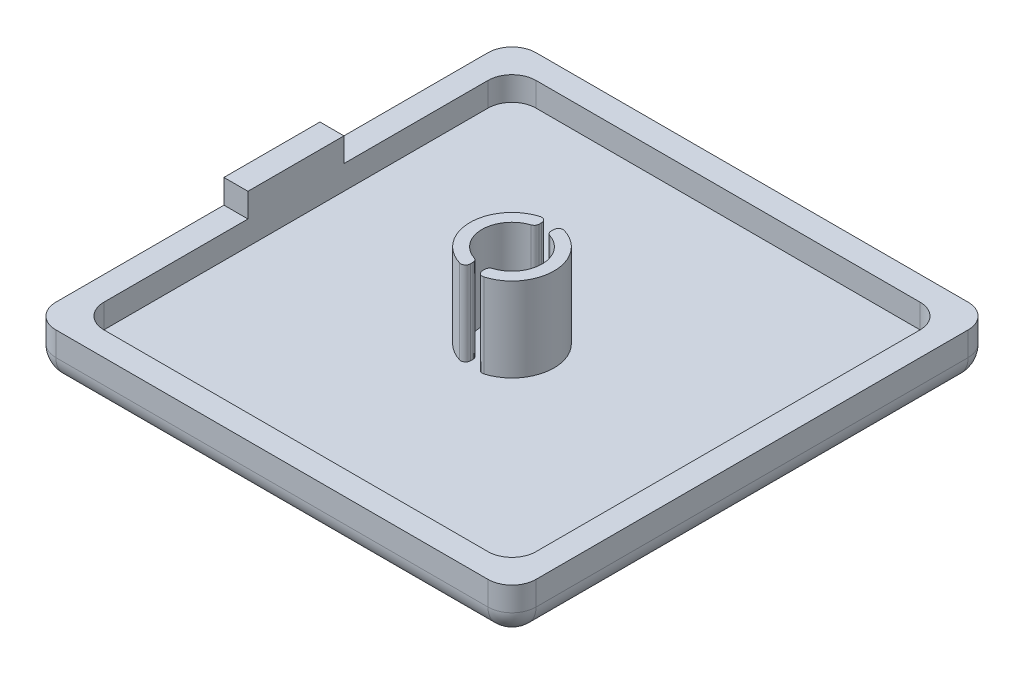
ISO-10303-21;
HEADER;
FILE_DESCRIPTION(('STEP AP214'),'2;1');
FILE_NAME('part.step','',(''),(''),'','','');
FILE_SCHEMA(('AUTOMOTIVE_DESIGN { 1 0 10303 214 1 1 1 1 }'));
ENDSEC;
DATA;
#1=APPLICATION_CONTEXT('core data for automotive mechanical design processes');
#2=APPLICATION_PROTOCOL_DEFINITION('international standard','automotive_design',2000,#1);
#3=PRODUCT_CONTEXT('',#1,'mechanical');
#4=PRODUCT('Part','Part','',(#3));
#5=PRODUCT_RELATED_PRODUCT_CATEGORY('part','',(#4));
#6=PRODUCT_DEFINITION_FORMATION('','',#4);
#7=PRODUCT_DEFINITION_CONTEXT('part definition',#1,'design');
#8=PRODUCT_DEFINITION('design','',#6,#7);
#9=PRODUCT_DEFINITION_SHAPE('','',#8);
#10=(LENGTH_UNIT() NAMED_UNIT(*) SI_UNIT(.MILLI.,.METRE.));
#11=(NAMED_UNIT(*) PLANE_ANGLE_UNIT() SI_UNIT($,.RADIAN.));
#12=(NAMED_UNIT(*) SI_UNIT($,.STERADIAN.) SOLID_ANGLE_UNIT());
#13=UNCERTAINTY_MEASURE_WITH_UNIT(LENGTH_MEASURE(1.E-05),#10,'distance_accuracy_value','');
#14=(GEOMETRIC_REPRESENTATION_CONTEXT(3) GLOBAL_UNCERTAINTY_ASSIGNED_CONTEXT((#13)) GLOBAL_UNIT_ASSIGNED_CONTEXT((#10,
#11,#12)) REPRESENTATION_CONTEXT('',''));
#15=CARTESIAN_POINT('',(0.,0.,0.));
#16=DIRECTION('',(0.,0.,1.));
#17=DIRECTION('',(1.,0.,0.));
#18=AXIS2_PLACEMENT_3D('',#15,#16,#17);
#19=CARTESIAN_POINT('',(0.,2.,0.));
#20=DIRECTION('',(0.,1.,0.));
#21=DIRECTION('',(0.,0.,1.));
#22=AXIS2_PLACEMENT_3D('',#19,#20,#21);
#23=PLANE('',#22);
#24=DIRECTION('',(1.,0.,0.));
#25=VECTOR('',#24,1.);
#26=CARTESIAN_POINT('',(0.,2.,-37.9988183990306));
#27=LINE('',#26,#25);
#28=CARTESIAN_POINT('',(4.,2.,-37.9988183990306));
#29=VERTEX_POINT('',#28);
#30=CARTESIAN_POINT('',(36.,2.,-37.9988183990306));
#31=VERTEX_POINT('',#30);
#32=EDGE_CURVE('E1180',#29,#31,#27,.T.);
#33=ORIENTED_EDGE('',*,*,#32,.F.);
#34=CARTESIAN_POINT('',(4.,2.,-35.9988183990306));
#35=DIRECTION('',(0.,1.,0.));
#36=DIRECTION('',(0.,0.,1.));
#37=AXIS2_PLACEMENT_3D('',#34,#35,#36);
#38=CIRCLE('',#37,2.);
#39=CARTESIAN_POINT('',(2.,2.,-35.9988183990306));
#40=VERTEX_POINT('',#39);
#41=EDGE_CURVE('E524',#29,#40,#38,.T.);
#42=ORIENTED_EDGE('',*,*,#41,.T.);
#43=DIRECTION('',(0.,0.,1.));
#44=VECTOR('',#43,1.);
#45=CARTESIAN_POINT('',(2.,2.,0.));
#46=LINE('',#45,#44);
#47=CARTESIAN_POINT('',(2.,2.,-4.));
#48=VERTEX_POINT('',#47);
#49=EDGE_CURVE('E1183',#40,#48,#46,.T.);
#50=ORIENTED_EDGE('',*,*,#49,.T.);
#51=CARTESIAN_POINT('',(4.,2.,-4.));
#52=DIRECTION('',(0.,1.,0.));
#53=DIRECTION('',(0.,0.,1.));
#54=AXIS2_PLACEMENT_3D('',#51,#52,#53);
#55=CIRCLE('',#54,2.);
#56=CARTESIAN_POINT('',(4.,2.,-2.));
#57=VERTEX_POINT('',#56);
#58=EDGE_CURVE('E533',#48,#57,#55,.T.);
#59=ORIENTED_EDGE('',*,*,#58,.T.);
#60=DIRECTION('',(1.,0.,0.));
#61=VECTOR('',#60,1.);
#62=CARTESIAN_POINT('',(0.,2.,-2.));
#63=LINE('',#62,#61);
#64=CARTESIAN_POINT('',(36.,2.,-2.));
#65=VERTEX_POINT('',#64);
#66=EDGE_CURVE('E354',#57,#65,#63,.T.);
#67=ORIENTED_EDGE('',*,*,#66,.T.);
#68=CARTESIAN_POINT('',(36.,2.,-4.));
#69=DIRECTION('',(0.,1.,0.));
#70=DIRECTION('',(0.,0.,1.));
#71=AXIS2_PLACEMENT_3D('',#68,#69,#70);
#72=CIRCLE('',#71,2.);
#73=CARTESIAN_POINT('',(38.,2.,-4.));
#74=VERTEX_POINT('',#73);
#75=EDGE_CURVE('E530',#65,#74,#72,.T.);
#76=ORIENTED_EDGE('',*,*,#75,.T.);
#77=DIRECTION('',(0.,0.,1.));
#78=VECTOR('',#77,1.);
#79=CARTESIAN_POINT('',(38.,2.,0.));
#80=LINE('',#79,#78);
#81=CARTESIAN_POINT('',(38.,2.,-35.9988183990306));
#82=VERTEX_POINT('',#81);
#83=EDGE_CURVE('E387',#82,#74,#80,.T.);
#84=ORIENTED_EDGE('',*,*,#83,.F.);
#85=CARTESIAN_POINT('',(36.,2.,-35.9988183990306));
#86=DIRECTION('',(0.,1.,0.));
#87=DIRECTION('',(0.,0.,1.));
#88=AXIS2_PLACEMENT_3D('',#85,#86,#87);
#89=CIRCLE('',#88,2.);
#90=EDGE_CURVE('E527',#82,#31,#89,.T.);
#91=ORIENTED_EDGE('',*,*,#90,.T.);
#92=EDGE_LOOP('',(#33,#42,#50,#59,#67,#76,#84,#91));
#93=FACE_BOUND('',#92,.T.);
#94=CARTESIAN_POINT('',(20.,2.,-19.9994091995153));
#95=DIRECTION('',(0.,-1.,0.));
#96=DIRECTION('',(0.,0.,1.));
#97=AXIS2_PLACEMENT_3D('',#94,#95,#96);
#98=CIRCLE('',#97,2.5);
#99=CARTESIAN_POINT('',(20.7758620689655,2.,-22.375969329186));
#100=VERTEX_POINT('',#99);
#101=CARTESIAN_POINT('',(20.7758620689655,2.,-17.6228490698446));
#102=VERTEX_POINT('',#101);
#103=EDGE_CURVE('E1095',#100,#102,#98,.T.);
#104=ORIENTED_EDGE('',*,*,#103,.F.);
#105=CARTESIAN_POINT('',(20.9,2.,-22.7562189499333));
#106=DIRECTION('',(0.,1.,0.));
#107=DIRECTION('',(0.,0.,1.));
#108=AXIS2_PLACEMENT_3D('',#105,#106,#107);
#109=CIRCLE('',#108,0.400000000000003);
#110=CARTESIAN_POINT('',(20.5,2.,-22.7562189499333));
#111=VERTEX_POINT('',#110);
#112=EDGE_CURVE('E1089',#111,#100,#109,.T.);
#113=ORIENTED_EDGE('',*,*,#112,.F.);
#114=DIRECTION('',(0.,0.,1.));
#115=VECTOR('',#114,1.);
#116=CARTESIAN_POINT('',(20.5,2.,-22.7562189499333));
#117=LINE('',#116,#115);
#118=CARTESIAN_POINT('',(20.5,2.,-22.9658885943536));
#119=VERTEX_POINT('',#118);
#120=EDGE_CURVE('E1107',#119,#111,#117,.T.);
#121=ORIENTED_EDGE('',*,*,#120,.F.);
#122=CARTESIAN_POINT('',(20.9,2.,-22.9658885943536));
#123=DIRECTION('',(0.,1.,0.));
#124=DIRECTION('',(0.,0.,-1.));
#125=AXIS2_PLACEMENT_3D('',#122,#123,#124);
#126=CIRCLE('',#125,0.400000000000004);
#127=CARTESIAN_POINT('',(21.016129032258,2.,-23.3486601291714));
#128=VERTEX_POINT('',#127);
#129=EDGE_CURVE('E1143',#128,#119,#126,.T.);
#130=ORIENTED_EDGE('',*,*,#129,.F.);
#131=CARTESIAN_POINT('',(20.,2.,-19.9994091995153));
#132=DIRECTION('',(0.,1.,0.));
#133=DIRECTION('',(0.,0.,1.));
#134=AXIS2_PLACEMENT_3D('',#131,#132,#133);
#135=CIRCLE('',#134,3.5);
#136=CARTESIAN_POINT('',(21.0161290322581,2.,-16.6501582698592));
#137=VERTEX_POINT('',#136);
#138=EDGE_CURVE('E1140',#137,#128,#135,.T.);
#139=ORIENTED_EDGE('',*,*,#138,.F.);
#140=CARTESIAN_POINT('',(20.9,2.,-17.032929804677));
#141=DIRECTION('',(0.,1.,0.));
#142=DIRECTION('',(0.,0.,1.));
#143=AXIS2_PLACEMENT_3D('',#140,#141,#142);
#144=CIRCLE('',#143,0.399999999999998);
#145=CARTESIAN_POINT('',(20.5,2.,-17.032929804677));
#146=VERTEX_POINT('',#145);
#147=EDGE_CURVE('E1137',#146,#137,#144,.T.);
#148=ORIENTED_EDGE('',*,*,#147,.F.);
#149=DIRECTION('',(0.,0.,1.));
#150=VECTOR('',#149,1.);
#151=CARTESIAN_POINT('',(20.5,2.,-17.2425994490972));
#152=LINE('',#151,#150);
#153=CARTESIAN_POINT('',(20.5,2.,-17.2425994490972));
#154=VERTEX_POINT('',#153);
#155=EDGE_CURVE('E1134',#154,#146,#152,.T.);
#156=ORIENTED_EDGE('',*,*,#155,.F.);
#157=CARTESIAN_POINT('',(20.9,2.,-17.2425994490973));
#158=DIRECTION('',(0.,1.,0.));
#159=DIRECTION('',(0.,0.,-1.));
#160=AXIS2_PLACEMENT_3D('',#157,#158,#159);
#161=CIRCLE('',#160,0.4);
#162=EDGE_CURVE('E1131',#102,#154,#161,.T.);
#163=ORIENTED_EDGE('',*,*,#162,.F.);
#164=EDGE_LOOP('',(#104,#113,#121,#130,#139,#148,#156,#163));
#165=FACE_BOUND('',#164,.T.);
#166=DIRECTION('',(0.,0.,-1.));
#167=VECTOR('',#166,1.);
#168=CARTESIAN_POINT('',(19.5,2.,-17.2425994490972));
#169=LINE('',#168,#167);
#170=CARTESIAN_POINT('',(19.5,2.,-17.032929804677));
#171=VERTEX_POINT('',#170);
#172=CARTESIAN_POINT('',(19.5,2.,-17.2425994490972));
#173=VERTEX_POINT('',#172);
#174=EDGE_CURVE('E1212',#171,#173,#169,.T.);
#175=ORIENTED_EDGE('',*,*,#174,.F.);
#176=CARTESIAN_POINT('',(19.1,2.,-17.032929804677));
#177=DIRECTION('',(0.,1.,0.));
#178=DIRECTION('',(0.,0.,-1.));
#179=AXIS2_PLACEMENT_3D('',#176,#177,#178);
#180=CIRCLE('',#179,0.400000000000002);
#181=CARTESIAN_POINT('',(18.9838709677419,2.,-16.6501582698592));
#182=VERTEX_POINT('',#181);
#183=EDGE_CURVE('E340',#182,#171,#180,.T.);
#184=ORIENTED_EDGE('',*,*,#183,.F.);
#185=CARTESIAN_POINT('',(20.,2.,-19.9994091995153));
#186=DIRECTION('',(0.,1.,0.));
#187=DIRECTION('',(0.,0.,1.));
#188=AXIS2_PLACEMENT_3D('',#185,#186,#187);
#189=CIRCLE('',#188,3.5);
#190=CARTESIAN_POINT('',(18.9838709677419,2.,-23.3486601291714));
#191=VERTEX_POINT('',#190);
#192=EDGE_CURVE('E1082',#191,#182,#189,.T.);
#193=ORIENTED_EDGE('',*,*,#192,.F.);
#194=CARTESIAN_POINT('',(19.1,2.,-22.9658885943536));
#195=DIRECTION('',(0.,1.,0.));
#196=DIRECTION('',(0.,0.,1.));
#197=AXIS2_PLACEMENT_3D('',#194,#195,#196);
#198=CIRCLE('',#197,0.400000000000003);
#199=CARTESIAN_POINT('',(19.5,2.,-22.9658885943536));
#200=VERTEX_POINT('',#199);
#201=EDGE_CURVE('E1227',#200,#191,#198,.T.);
#202=ORIENTED_EDGE('',*,*,#201,.F.);
#203=DIRECTION('',(0.,0.,-1.));
#204=VECTOR('',#203,1.);
#205=CARTESIAN_POINT('',(19.5,2.,-22.7562189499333));
#206=LINE('',#205,#204);
#207=CARTESIAN_POINT('',(19.5,2.,-22.7562189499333));
#208=VERTEX_POINT('',#207);
#209=EDGE_CURVE('E1224',#208,#200,#206,.T.);
#210=ORIENTED_EDGE('',*,*,#209,.F.);
#211=CARTESIAN_POINT('',(19.1,2.,-22.7562189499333));
#212=DIRECTION('',(0.,1.,0.));
#213=DIRECTION('',(0.,0.,1.));
#214=AXIS2_PLACEMENT_3D('',#211,#212,#213);
#215=CIRCLE('',#214,0.400000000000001);
#216=CARTESIAN_POINT('',(19.2241379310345,2.,-22.375969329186));
#217=VERTEX_POINT('',#216);
#218=EDGE_CURVE('E1221',#217,#208,#215,.T.);
#219=ORIENTED_EDGE('',*,*,#218,.F.);
#220=CARTESIAN_POINT('',(20.,2.,-19.9994091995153));
#221=DIRECTION('',(0.,-1.,0.));
#222=DIRECTION('',(0.,0.,1.));
#223=AXIS2_PLACEMENT_3D('',#220,#221,#222);
#224=CIRCLE('',#223,2.5);
#225=CARTESIAN_POINT('',(19.2241379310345,2.,-17.6228490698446));
#226=VERTEX_POINT('',#225);
#227=EDGE_CURVE('E1218',#226,#217,#224,.T.);
#228=ORIENTED_EDGE('',*,*,#227,.F.);
#229=CARTESIAN_POINT('',(19.1,2.,-17.2425994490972));
#230=DIRECTION('',(0.,1.,0.));
#231=DIRECTION('',(0.,0.,1.));
#232=AXIS2_PLACEMENT_3D('',#229,#230,#231);
#233=CIRCLE('',#232,0.400000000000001);
#234=EDGE_CURVE('E1215',#173,#226,#233,.T.);
#235=ORIENTED_EDGE('',*,*,#234,.F.);
#236=EDGE_LOOP('',(#175,#184,#193,#202,#210,#219,#228,#235));
#237=FACE_BOUND('',#236,.T.);
#238=ADVANCED_FACE('F43',(#93,#165,#237),#23,.T.);
#239=CARTESIAN_POINT('',(0.,4.,0.));
#240=DIRECTION('',(0.,1.,0.));
#241=DIRECTION('',(0.,0.,1.));
#242=AXIS2_PLACEMENT_3D('',#239,#240,#241);
#243=PLANE('',#242);
#244=DIRECTION('',(-1.,0.,0.));
#245=VECTOR('',#244,1.);
#246=CARTESIAN_POINT('',(2.,4.,-24.));
#247=LINE('',#246,#245);
#248=CARTESIAN_POINT('',(2.,4.,-24.));
#249=VERTEX_POINT('',#248);
#250=CARTESIAN_POINT('',(0.,4.,-24.));
#251=VERTEX_POINT('',#250);
#252=EDGE_CURVE('E303',#249,#251,#247,.T.);
#253=ORIENTED_EDGE('',*,*,#252,.F.);
#254=DIRECTION('',(0.,0.,1.));
#255=VECTOR('',#254,1.);
#256=CARTESIAN_POINT('',(2.,4.,-37.9988183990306));
#257=LINE('',#256,#255);
#258=CARTESIAN_POINT('',(2.,4.,-35.9988183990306));
#259=VERTEX_POINT('',#258);
#260=EDGE_CURVE('E318',#259,#249,#257,.T.);
#261=ORIENTED_EDGE('',*,*,#260,.F.);
#262=CARTESIAN_POINT('',(4.,4.,-35.9988183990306));
#263=DIRECTION('',(0.,1.,0.));
#264=DIRECTION('',(0.,0.,1.));
#265=AXIS2_PLACEMENT_3D('',#262,#263,#264);
#266=CIRCLE('',#265,2.);
#267=CARTESIAN_POINT('',(4.,4.,-37.9988183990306));
#268=VERTEX_POINT('',#267);
#269=EDGE_CURVE('E459',#259,#268,#266,.F.);
#270=ORIENTED_EDGE('',*,*,#269,.T.);
#271=DIRECTION('',(-1.,0.,0.));
#272=VECTOR('',#271,1.);
#273=CARTESIAN_POINT('',(2.,4.,-37.9988183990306));
#274=LINE('',#273,#272);
#275=CARTESIAN_POINT('',(36.,4.,-37.9988183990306));
#276=VERTEX_POINT('',#275);
#277=EDGE_CURVE('E369',#276,#268,#274,.T.);
#278=ORIENTED_EDGE('',*,*,#277,.F.);
#279=CARTESIAN_POINT('',(36.,4.,-35.9988183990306));
#280=DIRECTION('',(0.,1.,0.));
#281=DIRECTION('',(0.,0.,1.));
#282=AXIS2_PLACEMENT_3D('',#279,#280,#281);
#283=CIRCLE('',#282,2.);
#284=CARTESIAN_POINT('',(38.,4.,-35.9988183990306));
#285=VERTEX_POINT('',#284);
#286=EDGE_CURVE('E456',#276,#285,#283,.F.);
#287=ORIENTED_EDGE('',*,*,#286,.T.);
#288=DIRECTION('',(0.,0.,-1.));
#289=VECTOR('',#288,1.);
#290=CARTESIAN_POINT('',(38.,4.,-37.9988183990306));
#291=LINE('',#290,#289);
#292=CARTESIAN_POINT('',(38.,4.,-4.));
#293=VERTEX_POINT('',#292);
#294=EDGE_CURVE('E365',#293,#285,#291,.T.);
#295=ORIENTED_EDGE('',*,*,#294,.F.);
#296=CARTESIAN_POINT('',(36.,4.,-4.));
#297=DIRECTION('',(0.,1.,0.));
#298=DIRECTION('',(0.,0.,1.));
#299=AXIS2_PLACEMENT_3D('',#296,#297,#298);
#300=CIRCLE('',#299,2.);
#301=CARTESIAN_POINT('',(36.,4.,-2.));
#302=VERTEX_POINT('',#301);
#303=EDGE_CURVE('E453',#293,#302,#300,.F.);
#304=ORIENTED_EDGE('',*,*,#303,.T.);
#305=DIRECTION('',(1.,0.,0.));
#306=VECTOR('',#305,1.);
#307=CARTESIAN_POINT('',(2.,4.,-2.));
#308=LINE('',#307,#306);
#309=CARTESIAN_POINT('',(4.,4.,-2.));
#310=VERTEX_POINT('',#309);
#311=EDGE_CURVE('E360',#310,#302,#308,.T.);
#312=ORIENTED_EDGE('',*,*,#311,.F.);
#313=CARTESIAN_POINT('',(4.,4.,-4.));
#314=DIRECTION('',(0.,1.,0.));
#315=DIRECTION('',(0.,0.,1.));
#316=AXIS2_PLACEMENT_3D('',#313,#314,#315);
#317=CIRCLE('',#316,2.);
#318=CARTESIAN_POINT('',(2.,4.,-4.));
#319=VERTEX_POINT('',#318);
#320=EDGE_CURVE('E449',#310,#319,#317,.F.);
#321=ORIENTED_EDGE('',*,*,#320,.T.);
#322=CARTESIAN_POINT('',(2.,4.,-16.));
#323=VERTEX_POINT('',#322);
#324=EDGE_CURVE('E347',#323,#319,#257,.T.);
#325=ORIENTED_EDGE('',*,*,#324,.F.);
#326=DIRECTION('',(-1.,0.,0.));
#327=VECTOR('',#326,1.);
#328=CARTESIAN_POINT('',(2.,4.,-16.));
#329=LINE('',#328,#327);
#330=CARTESIAN_POINT('',(0.,4.,-16.));
#331=VERTEX_POINT('',#330);
#332=EDGE_CURVE('E341',#323,#331,#329,.T.);
#333=ORIENTED_EDGE('',*,*,#332,.T.);
#334=DIRECTION('',(0.,0.,1.));
#335=VECTOR('',#334,1.);
#336=CARTESIAN_POINT('',(0.,4.,-40.));
#337=LINE('',#336,#335);
#338=CARTESIAN_POINT('',(0.,4.,-2.));
#339=VERTEX_POINT('',#338);
#340=EDGE_CURVE('E373',#331,#339,#337,.T.);
#341=ORIENTED_EDGE('',*,*,#340,.T.);
#342=CARTESIAN_POINT('',(2.,4.,-2.));
#343=DIRECTION('',(0.,1.,0.));
#344=DIRECTION('',(0.,0.,1.));
#345=AXIS2_PLACEMENT_3D('',#342,#343,#344);
#346=CIRCLE('',#345,2.);
#347=CARTESIAN_POINT('',(2.,4.,0.));
#348=VERTEX_POINT('',#347);
#349=EDGE_CURVE('E482',#339,#348,#346,.T.);
#350=ORIENTED_EDGE('',*,*,#349,.T.);
#351=DIRECTION('',(1.,0.,0.));
#352=VECTOR('',#351,1.);
#353=CARTESIAN_POINT('',(0.,4.,0.));
#354=LINE('',#353,#352);
#355=CARTESIAN_POINT('',(38.,4.,0.));
#356=VERTEX_POINT('',#355);
#357=EDGE_CURVE('E376',#348,#356,#354,.T.);
#358=ORIENTED_EDGE('',*,*,#357,.T.);
#359=CARTESIAN_POINT('',(38.,4.,-2.));
#360=DIRECTION('',(0.,1.,0.));
#361=DIRECTION('',(0.,0.,1.));
#362=AXIS2_PLACEMENT_3D('',#359,#360,#361);
#363=CIRCLE('',#362,2.);
#364=CARTESIAN_POINT('',(40.,4.,-2.));
#365=VERTEX_POINT('',#364);
#366=EDGE_CURVE('E485',#356,#365,#363,.T.);
#367=ORIENTED_EDGE('',*,*,#366,.T.);
#368=DIRECTION('',(0.,0.,-1.));
#369=VECTOR('',#368,1.);
#370=CARTESIAN_POINT('',(40.,4.,-40.));
#371=LINE('',#370,#369);
#372=CARTESIAN_POINT('',(40.,4.,-38.));
#373=VERTEX_POINT('',#372);
#374=EDGE_CURVE('E546',#365,#373,#371,.T.);
#375=ORIENTED_EDGE('',*,*,#374,.T.);
#376=CARTESIAN_POINT('',(38.,4.,-38.));
#377=DIRECTION('',(0.,1.,0.));
#378=DIRECTION('',(0.,0.,1.));
#379=AXIS2_PLACEMENT_3D('',#376,#377,#378);
#380=CIRCLE('',#379,2.);
#381=CARTESIAN_POINT('',(38.,4.,-40.));
#382=VERTEX_POINT('',#381);
#383=EDGE_CURVE('E479',#373,#382,#380,.T.);
#384=ORIENTED_EDGE('',*,*,#383,.T.);
#385=DIRECTION('',(-1.,0.,0.));
#386=VECTOR('',#385,1.);
#387=CARTESIAN_POINT('',(0.,4.,-40.));
#388=LINE('',#387,#386);
#389=CARTESIAN_POINT('',(2.,4.,-40.));
#390=VERTEX_POINT('',#389);
#391=EDGE_CURVE('E543',#382,#390,#388,.T.);
#392=ORIENTED_EDGE('',*,*,#391,.T.);
#393=CARTESIAN_POINT('',(2.,4.,-38.));
#394=DIRECTION('',(0.,1.,0.));
#395=DIRECTION('',(0.,0.,1.));
#396=AXIS2_PLACEMENT_3D('',#393,#394,#395);
#397=CIRCLE('',#396,2.);
#398=CARTESIAN_POINT('',(0.,4.,-38.));
#399=VERTEX_POINT('',#398);
#400=EDGE_CURVE('E476',#390,#399,#397,.T.);
#401=ORIENTED_EDGE('',*,*,#400,.T.);
#402=EDGE_CURVE('E380',#399,#251,#337,.T.);
#403=ORIENTED_EDGE('',*,*,#402,.T.);
#404=EDGE_LOOP('',(#253,#261,#270,#278,#287,#295,#304,#312,#321,#325,#333,#341,#350,#358,#367,
#375,#384,#392,#401,#403));
#405=FACE_BOUND('',#404,.T.);
#406=ADVANCED_FACE('F556',(#405),#243,.T.);
#407=CARTESIAN_POINT('',(0.,0.,0.));
#408=DIRECTION('',(0.,1.,0.));
#409=DIRECTION('',(0.,0.,1.));
#410=AXIS2_PLACEMENT_3D('',#407,#408,#409);
#411=PLANE('',#410);
#412=DIRECTION('',(0.,0.,-1.));
#413=VECTOR('',#412,1.);
#414=CARTESIAN_POINT('',(38.,0.,0.));
#415=LINE('',#414,#413);
#416=CARTESIAN_POINT('',(38.,0.,-38.));
#417=VERTEX_POINT('',#416);
#418=CARTESIAN_POINT('',(38.,0.,-2.));
#419=VERTEX_POINT('',#418);
#420=EDGE_CURVE('E433',#417,#419,#415,.F.);
#421=ORIENTED_EDGE('',*,*,#420,.T.);
#422=DIRECTION('',(1.,0.,0.));
#423=VECTOR('',#422,1.);
#424=CARTESIAN_POINT('',(0.,0.,-2.));
#425=LINE('',#424,#423);
#426=CARTESIAN_POINT('',(2.,0.,-2.));
#427=VERTEX_POINT('',#426);
#428=EDGE_CURVE('E429',#419,#427,#425,.F.);
#429=ORIENTED_EDGE('',*,*,#428,.T.);
#430=DIRECTION('',(0.,0.,1.));
#431=VECTOR('',#430,1.);
#432=CARTESIAN_POINT('',(2.,0.,0.));
#433=LINE('',#432,#431);
#434=CARTESIAN_POINT('',(2.,0.,-38.));
#435=VERTEX_POINT('',#434);
#436=EDGE_CURVE('E439',#427,#435,#433,.F.);
#437=ORIENTED_EDGE('',*,*,#436,.T.);
#438=DIRECTION('',(-1.,0.,0.));
#439=VECTOR('',#438,1.);
#440=CARTESIAN_POINT('',(0.,0.,-38.));
#441=LINE('',#440,#439);
#442=EDGE_CURVE('E436',#435,#417,#441,.F.);
#443=ORIENTED_EDGE('',*,*,#442,.T.);
#444=EDGE_LOOP('',(#421,#429,#437,#443));
#445=FACE_BOUND('',#444,.T.);
#446=ADVANCED_FACE('F584',(#445),#411,.F.);
#447=CARTESIAN_POINT('',(0.,4.,-40.));
#448=DIRECTION('',(1.,0.,0.));
#449=DIRECTION('',(0.,0.,-1.));
#450=AXIS2_PLACEMENT_3D('',#447,#448,#449);
#451=PLANE('',#450);
#452=DIRECTION('',(0.,-1.,0.));
#453=VECTOR('',#452,1.);
#454=CARTESIAN_POINT('',(0.,4.,-38.));
#455=LINE('',#454,#453);
#456=CARTESIAN_POINT('',(0.,2.,-38.));
#457=VERTEX_POINT('',#456);
#458=EDGE_CURVE('E495',#399,#457,#455,.T.);
#459=ORIENTED_EDGE('',*,*,#458,.T.);
#460=DIRECTION('',(0.,0.,1.));
#461=VECTOR('',#460,1.);
#462=CARTESIAN_POINT('',(0.,2.,-40.));
#463=LINE('',#462,#461);
#464=CARTESIAN_POINT('',(0.,2.,-2.));
#465=VERTEX_POINT('',#464);
#466=EDGE_CURVE('E11',#457,#465,#463,.T.);
#467=ORIENTED_EDGE('',*,*,#466,.T.);
#468=DIRECTION('',(0.,-1.,0.));
#469=VECTOR('',#468,1.);
#470=CARTESIAN_POINT('',(0.,4.,-2.));
#471=LINE('',#470,#469);
#472=EDGE_CURVE('E499',#465,#339,#471,.F.);
#473=ORIENTED_EDGE('',*,*,#472,.T.);
#474=ORIENTED_EDGE('',*,*,#340,.F.);
#475=DIRECTION('',(0.,-1.,0.));
#476=VECTOR('',#475,1.);
#477=CARTESIAN_POINT('',(0.,0.,-16.));
#478=LINE('',#477,#476);
#479=CARTESIAN_POINT('',(0.,6.,-16.));
#480=VERTEX_POINT('',#479);
#481=EDGE_CURVE('E61',#480,#331,#478,.T.);
#482=ORIENTED_EDGE('',*,*,#481,.F.);
#483=DIRECTION('',(0.,0.,1.));
#484=VECTOR('',#483,1.);
#485=CARTESIAN_POINT('',(0.,6.00000000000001,0.));
#486=LINE('',#485,#484);
#487=CARTESIAN_POINT('',(0.,6.,-24.));
#488=VERTEX_POINT('',#487);
#489=EDGE_CURVE('E329',#488,#480,#486,.T.);
#490=ORIENTED_EDGE('',*,*,#489,.F.);
#491=DIRECTION('',(0.,-1.,0.));
#492=VECTOR('',#491,1.);
#493=CARTESIAN_POINT('',(0.,0.,-24.));
#494=LINE('',#493,#492);
#495=EDGE_CURVE('E298',#488,#251,#494,.T.);
#496=ORIENTED_EDGE('',*,*,#495,.T.);
#497=ORIENTED_EDGE('',*,*,#402,.F.);
#498=EDGE_LOOP('',(#459,#467,#473,#474,#482,#490,#496,#497));
#499=FACE_BOUND('',#498,.T.);
#500=ADVANCED_FACE('F606',(#499),#451,.F.);
#501=CARTESIAN_POINT('',(0.,4.,0.));
#502=DIRECTION('',(0.,0.,-1.));
#503=DIRECTION('',(-1.,0.,0.));
#504=AXIS2_PLACEMENT_3D('',#501,#502,#503);
#505=PLANE('',#504);
#506=DIRECTION('',(0.,-1.,0.));
#507=VECTOR('',#506,1.);
#508=CARTESIAN_POINT('',(2.,4.,0.));
#509=LINE('',#508,#507);
#510=CARTESIAN_POINT('',(2.,2.,0.));
#511=VERTEX_POINT('',#510);
#512=EDGE_CURVE('E462',#348,#511,#509,.T.);
#513=ORIENTED_EDGE('',*,*,#512,.T.);
#514=DIRECTION('',(1.,0.,0.));
#515=VECTOR('',#514,1.);
#516=CARTESIAN_POINT('',(0.,2.,0.));
#517=LINE('',#516,#515);
#518=CARTESIAN_POINT('',(38.,2.,0.));
#519=VERTEX_POINT('',#518);
#520=EDGE_CURVE('E442',#511,#519,#517,.T.);
#521=ORIENTED_EDGE('',*,*,#520,.T.);
#522=DIRECTION('',(0.,-1.,0.));
#523=VECTOR('',#522,1.);
#524=CARTESIAN_POINT('',(38.,4.,0.));
#525=LINE('',#524,#523);
#526=EDGE_CURVE('E466',#519,#356,#525,.F.);
#527=ORIENTED_EDGE('',*,*,#526,.T.);
#528=ORIENTED_EDGE('',*,*,#357,.F.);
#529=EDGE_LOOP('',(#513,#521,#527,#528));
#530=FACE_BOUND('',#529,.T.);
#531=ADVANCED_FACE('F619',(#530),#505,.F.);
#532=CARTESIAN_POINT('',(40.,4.,-40.));
#533=DIRECTION('',(-1.,0.,0.));
#534=DIRECTION('',(0.,0.,1.));
#535=AXIS2_PLACEMENT_3D('',#532,#533,#534);
#536=PLANE('',#535);
#537=DIRECTION('',(0.,-1.,0.));
#538=VECTOR('',#537,1.);
#539=CARTESIAN_POINT('',(40.,4.,-2.));
#540=LINE('',#539,#538);
#541=CARTESIAN_POINT('',(40.,2.,-2.));
#542=VERTEX_POINT('',#541);
#543=EDGE_CURVE('E472',#365,#542,#540,.T.);
#544=ORIENTED_EDGE('',*,*,#543,.T.);
#545=DIRECTION('',(0.,0.,-1.));
#546=VECTOR('',#545,1.);
#547=CARTESIAN_POINT('',(40.,2.,-40.));
#548=LINE('',#547,#546);
#549=CARTESIAN_POINT('',(40.,2.,-38.));
#550=VERTEX_POINT('',#549);
#551=EDGE_CURVE('E423',#542,#550,#548,.T.);
#552=ORIENTED_EDGE('',*,*,#551,.T.);
#553=DIRECTION('',(0.,-1.,0.));
#554=VECTOR('',#553,1.);
#555=CARTESIAN_POINT('',(40.,4.,-38.));
#556=LINE('',#555,#554);
#557=EDGE_CURVE('E469',#550,#373,#556,.F.);
#558=ORIENTED_EDGE('',*,*,#557,.T.);
#559=ORIENTED_EDGE('',*,*,#374,.F.);
#560=EDGE_LOOP('',(#544,#552,#558,#559));
#561=FACE_BOUND('',#560,.T.);
#562=ADVANCED_FACE('F567',(#561),#536,.F.);
#563=CARTESIAN_POINT('',(0.,4.,-40.));
#564=DIRECTION('',(0.,0.,1.));
#565=DIRECTION('',(1.,0.,0.));
#566=AXIS2_PLACEMENT_3D('',#563,#564,#565);
#567=PLANE('',#566);
#568=DIRECTION('',(0.,-1.,0.));
#569=VECTOR('',#568,1.);
#570=CARTESIAN_POINT('',(38.,4.,-40.));
#571=LINE('',#570,#569);
#572=CARTESIAN_POINT('',(38.,2.,-40.));
#573=VERTEX_POINT('',#572);
#574=EDGE_CURVE('E491',#382,#573,#571,.T.);
#575=ORIENTED_EDGE('',*,*,#574,.T.);
#576=DIRECTION('',(-1.,0.,0.));
#577=VECTOR('',#576,1.);
#578=CARTESIAN_POINT('',(0.,2.,-40.));
#579=LINE('',#578,#577);
#580=CARTESIAN_POINT('',(2.,2.,-40.));
#581=VERTEX_POINT('',#580);
#582=EDGE_CURVE('E417',#573,#581,#579,.T.);
#583=ORIENTED_EDGE('',*,*,#582,.T.);
#584=DIRECTION('',(0.,-1.,0.));
#585=VECTOR('',#584,1.);
#586=CARTESIAN_POINT('',(2.,4.,-40.));
#587=LINE('',#586,#585);
#588=EDGE_CURVE('E488',#581,#390,#587,.F.);
#589=ORIENTED_EDGE('',*,*,#588,.T.);
#590=ORIENTED_EDGE('',*,*,#391,.F.);
#591=EDGE_LOOP('',(#575,#583,#589,#590));
#592=FACE_BOUND('',#591,.T.);
#593=ADVANCED_FACE('F598',(#592),#567,.F.);
#594=CARTESIAN_POINT('',(2.,4.,-37.9988183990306));
#595=DIRECTION('',(1.,0.,0.));
#596=DIRECTION('',(0.,0.,-1.));
#597=AXIS2_PLACEMENT_3D('',#594,#595,#596);
#598=PLANE('',#597);
#599=ORIENTED_EDGE('',*,*,#49,.F.);
#600=DIRECTION('',(0.,-1.,0.));
#601=VECTOR('',#600,1.);
#602=CARTESIAN_POINT('',(2.,4.,-35.9988183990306));
#603=LINE('',#602,#601);
#604=EDGE_CURVE('E517',#40,#259,#603,.F.);
#605=ORIENTED_EDGE('',*,*,#604,.T.);
#606=ORIENTED_EDGE('',*,*,#260,.T.);
#607=DIRECTION('',(0.,-1.,0.));
#608=VECTOR('',#607,1.);
#609=CARTESIAN_POINT('',(2.,0.,-24.));
#610=LINE('',#609,#608);
#611=CARTESIAN_POINT('',(2.,6.,-24.));
#612=VERTEX_POINT('',#611);
#613=EDGE_CURVE('E295',#612,#249,#610,.T.);
#614=ORIENTED_EDGE('',*,*,#613,.F.);
#615=DIRECTION('',(0.,0.,1.));
#616=VECTOR('',#615,1.);
#617=CARTESIAN_POINT('',(2.,6.00000000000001,0.));
#618=LINE('',#617,#616);
#619=CARTESIAN_POINT('',(2.,6.,-16.));
#620=VERTEX_POINT('',#619);
#621=EDGE_CURVE('E308',#612,#620,#618,.T.);
#622=ORIENTED_EDGE('',*,*,#621,.T.);
#623=DIRECTION('',(0.,-1.,0.));
#624=VECTOR('',#623,1.);
#625=CARTESIAN_POINT('',(2.,0.,-16.));
#626=LINE('',#625,#624);
#627=EDGE_CURVE('E304',#620,#323,#626,.T.);
#628=ORIENTED_EDGE('',*,*,#627,.T.);
#629=ORIENTED_EDGE('',*,*,#324,.T.);
#630=DIRECTION('',(0.,-1.,0.));
#631=VECTOR('',#630,1.);
#632=CARTESIAN_POINT('',(2.,2.,-4.));
#633=LINE('',#632,#631);
#634=EDGE_CURVE('E520',#319,#48,#633,.T.);
#635=ORIENTED_EDGE('',*,*,#634,.T.);
#636=EDGE_LOOP('',(#599,#605,#606,#614,#622,#628,#629,#635));
#637=FACE_BOUND('',#636,.T.);
#638=ADVANCED_FACE('F316',(#637),#598,.T.);
#639=CARTESIAN_POINT('',(2.,4.,-2.));
#640=DIRECTION('',(0.,0.,-1.));
#641=DIRECTION('',(-1.,0.,0.));
#642=AXIS2_PLACEMENT_3D('',#639,#640,#641);
#643=PLANE('',#642);
#644=ORIENTED_EDGE('',*,*,#311,.T.);
#645=DIRECTION('',(0.,-1.,0.));
#646=VECTOR('',#645,1.);
#647=CARTESIAN_POINT('',(36.,2.,-2.));
#648=LINE('',#647,#646);
#649=EDGE_CURVE('E503',#302,#65,#648,.T.);
#650=ORIENTED_EDGE('',*,*,#649,.T.);
#651=ORIENTED_EDGE('',*,*,#66,.F.);
#652=DIRECTION('',(0.,-1.,0.));
#653=VECTOR('',#652,1.);
#654=CARTESIAN_POINT('',(4.,4.,-2.));
#655=LINE('',#654,#653);
#656=EDGE_CURVE('E507',#57,#310,#655,.F.);
#657=ORIENTED_EDGE('',*,*,#656,.T.);
#658=EDGE_LOOP('',(#644,#650,#651,#657));
#659=FACE_BOUND('',#658,.T.);
#660=ADVANCED_FACE('F649',(#659),#643,.T.);
#661=CARTESIAN_POINT('',(38.,4.,-37.9988183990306));
#662=DIRECTION('',(-1.,0.,0.));
#663=DIRECTION('',(0.,0.,1.));
#664=AXIS2_PLACEMENT_3D('',#661,#662,#663);
#665=PLANE('',#664);
#666=ORIENTED_EDGE('',*,*,#294,.T.);
#667=DIRECTION('',(0.,-1.,0.));
#668=VECTOR('',#667,1.);
#669=CARTESIAN_POINT('',(38.,2.,-35.9988183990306));
#670=LINE('',#669,#668);
#671=EDGE_CURVE('E510',#285,#82,#670,.T.);
#672=ORIENTED_EDGE('',*,*,#671,.T.);
#673=ORIENTED_EDGE('',*,*,#83,.T.);
#674=DIRECTION('',(0.,-1.,0.));
#675=VECTOR('',#674,1.);
#676=CARTESIAN_POINT('',(38.,4.,-4.));
#677=LINE('',#676,#675);
#678=EDGE_CURVE('E514',#74,#293,#677,.F.);
#679=ORIENTED_EDGE('',*,*,#678,.T.);
#680=EDGE_LOOP('',(#666,#672,#673,#679));
#681=FACE_BOUND('',#680,.T.);
#682=ADVANCED_FACE('F645',(#681),#665,.T.);
#683=CARTESIAN_POINT('',(2.,4.,-37.9988183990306));
#684=DIRECTION('',(0.,0.,1.));
#685=DIRECTION('',(1.,0.,0.));
#686=AXIS2_PLACEMENT_3D('',#683,#684,#685);
#687=PLANE('',#686);
#688=ORIENTED_EDGE('',*,*,#277,.T.);
#689=DIRECTION('',(0.,-1.,0.));
#690=VECTOR('',#689,1.);
#691=CARTESIAN_POINT('',(4.,2.,-37.9988183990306));
#692=LINE('',#691,#690);
#693=EDGE_CURVE('E536',#268,#29,#692,.T.);
#694=ORIENTED_EDGE('',*,*,#693,.T.);
#695=ORIENTED_EDGE('',*,*,#32,.T.);
#696=DIRECTION('',(0.,-1.,0.));
#697=VECTOR('',#696,1.);
#698=CARTESIAN_POINT('',(36.,4.,-37.9988183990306));
#699=LINE('',#698,#697);
#700=EDGE_CURVE('E540',#31,#276,#699,.F.);
#701=ORIENTED_EDGE('',*,*,#700,.T.);
#702=EDGE_LOOP('',(#688,#694,#695,#701));
#703=FACE_BOUND('',#702,.T.);
#704=ADVANCED_FACE('F641',(#703),#687,.T.);
#705=CARTESIAN_POINT('',(4.,4.,-35.9988183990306));
#706=DIRECTION('',(0.,1.,0.));
#707=DIRECTION('',(0.,0.,1.));
#708=AXIS2_PLACEMENT_3D('',#705,#706,#707);
#709=CYLINDRICAL_SURFACE('',#708,2.);
#710=ORIENTED_EDGE('',*,*,#269,.F.);
#711=ORIENTED_EDGE('',*,*,#604,.F.);
#712=ORIENTED_EDGE('',*,*,#41,.F.);
#713=ORIENTED_EDGE('',*,*,#693,.F.);
#714=EDGE_LOOP('',(#710,#711,#712,#713));
#715=FACE_BOUND('',#714,.T.);
#716=ADVANCED_FACE('F644',(#715),#709,.F.);
#717=CARTESIAN_POINT('',(36.,4.,-35.9988183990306));
#718=DIRECTION('',(0.,1.,0.));
#719=DIRECTION('',(0.,0.,1.));
#720=AXIS2_PLACEMENT_3D('',#717,#718,#719);
#721=CYLINDRICAL_SURFACE('',#720,2.);
#722=ORIENTED_EDGE('',*,*,#286,.F.);
#723=ORIENTED_EDGE('',*,*,#700,.F.);
#724=ORIENTED_EDGE('',*,*,#90,.F.);
#725=ORIENTED_EDGE('',*,*,#671,.F.);
#726=EDGE_LOOP('',(#722,#723,#724,#725));
#727=FACE_BOUND('',#726,.T.);
#728=ADVANCED_FACE('F688',(#727),#721,.F.);
#729=CARTESIAN_POINT('',(36.,4.,-4.));
#730=DIRECTION('',(0.,1.,0.));
#731=DIRECTION('',(0.,0.,1.));
#732=AXIS2_PLACEMENT_3D('',#729,#730,#731);
#733=CYLINDRICAL_SURFACE('',#732,2.);
#734=ORIENTED_EDGE('',*,*,#303,.F.);
#735=ORIENTED_EDGE('',*,*,#678,.F.);
#736=ORIENTED_EDGE('',*,*,#75,.F.);
#737=ORIENTED_EDGE('',*,*,#649,.F.);
#738=EDGE_LOOP('',(#734,#735,#736,#737));
#739=FACE_BOUND('',#738,.T.);
#740=ADVANCED_FACE('F696',(#739),#733,.F.);
#741=CARTESIAN_POINT('',(4.,4.,-4.));
#742=DIRECTION('',(0.,1.,0.));
#743=DIRECTION('',(0.,0.,1.));
#744=AXIS2_PLACEMENT_3D('',#741,#742,#743);
#745=CYLINDRICAL_SURFACE('',#744,2.);
#746=ORIENTED_EDGE('',*,*,#320,.F.);
#747=ORIENTED_EDGE('',*,*,#656,.F.);
#748=ORIENTED_EDGE('',*,*,#58,.F.);
#749=ORIENTED_EDGE('',*,*,#634,.F.);
#750=EDGE_LOOP('',(#746,#747,#748,#749));
#751=FACE_BOUND('',#750,.T.);
#752=ADVANCED_FACE('F704',(#751),#745,.F.);
#753=CARTESIAN_POINT('',(2.,4.,-38.));
#754=DIRECTION('',(0.,-1.,0.));
#755=DIRECTION('',(0.,0.,-1.));
#756=AXIS2_PLACEMENT_3D('',#753,#754,#755);
#757=CYLINDRICAL_SURFACE('',#756,2.);
#758=ORIENTED_EDGE('',*,*,#588,.F.);
#759=CARTESIAN_POINT('',(2.,2.,-38.));
#760=DIRECTION('',(0.,-1.,0.));
#761=DIRECTION('',(0.,0.,-1.));
#762=AXIS2_PLACEMENT_3D('',#759,#760,#761);
#763=CIRCLE('',#762,2.);
#764=EDGE_CURVE('E53',#581,#457,#763,.F.);
#765=ORIENTED_EDGE('',*,*,#764,.T.);
#766=ORIENTED_EDGE('',*,*,#458,.F.);
#767=ORIENTED_EDGE('',*,*,#400,.F.);
#768=EDGE_LOOP('',(#758,#765,#766,#767));
#769=FACE_BOUND('',#768,.T.);
#770=ADVANCED_FACE('F603',(#769),#757,.T.);
#771=CARTESIAN_POINT('',(38.,4.,-38.));
#772=DIRECTION('',(0.,-1.,0.));
#773=DIRECTION('',(0.,0.,-1.));
#774=AXIS2_PLACEMENT_3D('',#771,#772,#773);
#775=CYLINDRICAL_SURFACE('',#774,2.);
#776=ORIENTED_EDGE('',*,*,#557,.F.);
#777=CARTESIAN_POINT('',(38.,2.,-38.));
#778=DIRECTION('',(0.,-1.,0.));
#779=DIRECTION('',(0.,0.,-1.));
#780=AXIS2_PLACEMENT_3D('',#777,#778,#779);
#781=CIRCLE('',#780,2.);
#782=EDGE_CURVE('E420',#550,#573,#781,.F.);
#783=ORIENTED_EDGE('',*,*,#782,.T.);
#784=ORIENTED_EDGE('',*,*,#574,.F.);
#785=ORIENTED_EDGE('',*,*,#383,.F.);
#786=EDGE_LOOP('',(#776,#783,#784,#785));
#787=FACE_BOUND('',#786,.T.);
#788=ADVANCED_FACE('F595',(#787),#775,.T.);
#789=CARTESIAN_POINT('',(2.,4.,-2.));
#790=DIRECTION('',(0.,-1.,0.));
#791=DIRECTION('',(0.,0.,-1.));
#792=AXIS2_PLACEMENT_3D('',#789,#790,#791);
#793=CYLINDRICAL_SURFACE('',#792,2.);
#794=ORIENTED_EDGE('',*,*,#472,.F.);
#795=CARTESIAN_POINT('',(2.,2.,-2.));
#796=DIRECTION('',(0.,-1.,0.));
#797=DIRECTION('',(0.,0.,-1.));
#798=AXIS2_PLACEMENT_3D('',#795,#796,#797);
#799=CIRCLE('',#798,2.);
#800=EDGE_CURVE('E445',#465,#511,#799,.F.);
#801=ORIENTED_EDGE('',*,*,#800,.T.);
#802=ORIENTED_EDGE('',*,*,#512,.F.);
#803=ORIENTED_EDGE('',*,*,#349,.F.);
#804=EDGE_LOOP('',(#794,#801,#802,#803));
#805=FACE_BOUND('',#804,.T.);
#806=ADVANCED_FACE('F618',(#805),#793,.T.);
#807=CARTESIAN_POINT('',(38.,4.,-2.));
#808=DIRECTION('',(0.,-1.,0.));
#809=DIRECTION('',(0.,0.,-1.));
#810=AXIS2_PLACEMENT_3D('',#807,#808,#809);
#811=CYLINDRICAL_SURFACE('',#810,2.);
#812=ORIENTED_EDGE('',*,*,#526,.F.);
#813=CARTESIAN_POINT('',(38.,2.,-2.));
#814=DIRECTION('',(0.,-1.,0.));
#815=DIRECTION('',(0.,0.,-1.));
#816=AXIS2_PLACEMENT_3D('',#813,#814,#815);
#817=CIRCLE('',#816,2.);
#818=EDGE_CURVE('E426',#519,#542,#817,.F.);
#819=ORIENTED_EDGE('',*,*,#818,.T.);
#820=ORIENTED_EDGE('',*,*,#543,.F.);
#821=ORIENTED_EDGE('',*,*,#366,.F.);
#822=EDGE_LOOP('',(#812,#819,#820,#821));
#823=FACE_BOUND('',#822,.T.);
#824=ADVANCED_FACE('F563',(#823),#811,.T.);
#825=CARTESIAN_POINT('',(38.,2.,-38.));
#826=DIRECTION('',(0.,0.,1.));
#827=DIRECTION('',(1.,0.,0.));
#828=AXIS2_PLACEMENT_3D('',#825,#826,#827);
#829=SPHERICAL_SURFACE('',#828,2.);
#830=CARTESIAN_POINT('',(38.,2.,-38.));
#831=DIRECTION('',(-1.,0.,0.));
#832=DIRECTION('',(0.,0.,1.));
#833=AXIS2_PLACEMENT_3D('',#830,#831,#832);
#834=CIRCLE('',#833,2.);
#835=EDGE_CURVE('E388',#573,#417,#834,.T.);
#836=ORIENTED_EDGE('',*,*,#835,.F.);
#837=ORIENTED_EDGE('',*,*,#782,.F.);
#838=CARTESIAN_POINT('',(38.,2.,-38.));
#839=DIRECTION('',(0.,0.,1.));
#840=DIRECTION('',(1.,0.,0.));
#841=AXIS2_PLACEMENT_3D('',#838,#839,#840);
#842=CIRCLE('',#841,2.);
#843=EDGE_CURVE('E383',#417,#550,#842,.T.);
#844=ORIENTED_EDGE('',*,*,#843,.F.);
#845=EDGE_LOOP('',(#836,#837,#844));
#846=FACE_BOUND('',#845,.T.);
#847=ADVANCED_FACE('F45',(#846),#829,.T.);
#848=CARTESIAN_POINT('',(38.,2.,-40.));
#849=DIRECTION('',(0.,0.,-1.));
#850=DIRECTION('',(-1.,0.,0.));
#851=AXIS2_PLACEMENT_3D('',#848,#849,#850);
#852=CYLINDRICAL_SURFACE('',#851,2.);
#853=ORIENTED_EDGE('',*,*,#843,.T.);
#854=ORIENTED_EDGE('',*,*,#551,.F.);
#855=CARTESIAN_POINT('',(38.,2.,-2.));
#856=DIRECTION('',(0.,0.,1.));
#857=DIRECTION('',(1.,0.,0.));
#858=AXIS2_PLACEMENT_3D('',#855,#856,#857);
#859=CIRCLE('',#858,2.);
#860=EDGE_CURVE('E392',#419,#542,#859,.T.);
#861=ORIENTED_EDGE('',*,*,#860,.F.);
#862=ORIENTED_EDGE('',*,*,#420,.F.);
#863=EDGE_LOOP('',(#853,#854,#861,#862));
#864=FACE_BOUND('',#863,.T.);
#865=ADVANCED_FACE('F571',(#864),#852,.T.);
#866=CARTESIAN_POINT('',(0.,2.,-38.));
#867=DIRECTION('',(-1.,0.,0.));
#868=DIRECTION('',(0.,0.,1.));
#869=AXIS2_PLACEMENT_3D('',#866,#867,#868);
#870=CYLINDRICAL_SURFACE('',#869,2.);
#871=ORIENTED_EDGE('',*,*,#835,.T.);
#872=ORIENTED_EDGE('',*,*,#442,.F.);
#873=CARTESIAN_POINT('',(2.,2.,-38.));
#874=DIRECTION('',(-1.,0.,0.));
#875=DIRECTION('',(0.,0.,1.));
#876=AXIS2_PLACEMENT_3D('',#873,#874,#875);
#877=CIRCLE('',#876,2.);
#878=EDGE_CURVE('E396',#581,#435,#877,.T.);
#879=ORIENTED_EDGE('',*,*,#878,.F.);
#880=ORIENTED_EDGE('',*,*,#582,.F.);
#881=EDGE_LOOP('',(#871,#872,#879,#880));
#882=FACE_BOUND('',#881,.T.);
#883=ADVANCED_FACE('F590',(#882),#870,.T.);
#884=CARTESIAN_POINT('',(38.,2.,-2.));
#885=DIRECTION('',(0.,0.,1.));
#886=DIRECTION('',(1.,0.,0.));
#887=AXIS2_PLACEMENT_3D('',#884,#885,#886);
#888=SPHERICAL_SURFACE('',#887,2.);
#889=ORIENTED_EDGE('',*,*,#860,.T.);
#890=ORIENTED_EDGE('',*,*,#818,.F.);
#891=CARTESIAN_POINT('',(38.,2.,-2.));
#892=DIRECTION('',(-1.,0.,0.));
#893=DIRECTION('',(0.,0.,1.));
#894=AXIS2_PLACEMENT_3D('',#891,#892,#893);
#895=CIRCLE('',#894,2.);
#896=EDGE_CURVE('E400',#419,#519,#895,.T.);
#897=ORIENTED_EDGE('',*,*,#896,.F.);
#898=EDGE_LOOP('',(#889,#890,#897));
#899=FACE_BOUND('',#898,.T.);
#900=ADVANCED_FACE('F576',(#899),#888,.T.);
#901=CARTESIAN_POINT('',(2.,2.,-38.));
#902=DIRECTION('',(0.,0.,1.));
#903=DIRECTION('',(1.,0.,0.));
#904=AXIS2_PLACEMENT_3D('',#901,#902,#903);
#905=SPHERICAL_SURFACE('',#904,2.);
#906=ORIENTED_EDGE('',*,*,#764,.F.);
#907=ORIENTED_EDGE('',*,*,#878,.T.);
#908=CARTESIAN_POINT('',(2.,2.,-38.));
#909=DIRECTION('',(0.,0.,1.));
#910=DIRECTION('',(1.,0.,0.));
#911=AXIS2_PLACEMENT_3D('',#908,#909,#910);
#912=CIRCLE('',#911,2.);
#913=EDGE_CURVE('E404',#457,#435,#912,.T.);
#914=ORIENTED_EDGE('',*,*,#913,.F.);
#915=EDGE_LOOP('',(#906,#907,#914));
#916=FACE_BOUND('',#915,.T.);
#917=ADVANCED_FACE('F610',(#916),#905,.T.);
#918=CARTESIAN_POINT('',(0.,2.,-2.));
#919=DIRECTION('',(1.,0.,0.));
#920=DIRECTION('',(0.,0.,-1.));
#921=AXIS2_PLACEMENT_3D('',#918,#919,#920);
#922=CYLINDRICAL_SURFACE('',#921,2.);
#923=ORIENTED_EDGE('',*,*,#896,.T.);
#924=ORIENTED_EDGE('',*,*,#520,.F.);
#925=CARTESIAN_POINT('',(2.,2.,-2.));
#926=DIRECTION('',(-1.,0.,0.));
#927=DIRECTION('',(0.,0.,1.));
#928=AXIS2_PLACEMENT_3D('',#925,#926,#927);
#929=CIRCLE('',#928,2.);
#930=EDGE_CURVE('E408',#427,#511,#929,.T.);
#931=ORIENTED_EDGE('',*,*,#930,.F.);
#932=ORIENTED_EDGE('',*,*,#428,.F.);
#933=EDGE_LOOP('',(#923,#924,#931,#932));
#934=FACE_BOUND('',#933,.T.);
#935=ADVANCED_FACE('F581',(#934),#922,.T.);
#936=CARTESIAN_POINT('',(2.,2.,-40.));
#937=DIRECTION('',(0.,0.,1.));
#938=DIRECTION('',(1.,0.,0.));
#939=AXIS2_PLACEMENT_3D('',#936,#937,#938);
#940=CYLINDRICAL_SURFACE('',#939,2.);
#941=ORIENTED_EDGE('',*,*,#913,.T.);
#942=ORIENTED_EDGE('',*,*,#436,.F.);
#943=CARTESIAN_POINT('',(2.,2.,-2.));
#944=DIRECTION('',(0.,0.,1.));
#945=DIRECTION('',(0.,-1.,0.));
#946=AXIS2_PLACEMENT_3D('',#943,#944,#945);
#947=CIRCLE('',#946,2.);
#948=EDGE_CURVE('E411',#465,#427,#947,.T.);
#949=ORIENTED_EDGE('',*,*,#948,.F.);
#950=ORIENTED_EDGE('',*,*,#466,.F.);
#951=EDGE_LOOP('',(#941,#942,#949,#950));
#952=FACE_BOUND('',#951,.T.);
#953=ADVANCED_FACE('F613',(#952),#940,.T.);
#954=CARTESIAN_POINT('',(2.,2.,-2.));
#955=DIRECTION('',(0.,0.,1.));
#956=DIRECTION('',(1.,0.,0.));
#957=AXIS2_PLACEMENT_3D('',#954,#955,#956);
#958=SPHERICAL_SURFACE('',#957,2.);
#959=ORIENTED_EDGE('',*,*,#930,.T.);
#960=ORIENTED_EDGE('',*,*,#800,.F.);
#961=ORIENTED_EDGE('',*,*,#948,.T.);
#962=EDGE_LOOP('',(#959,#960,#961));
#963=FACE_BOUND('',#962,.T.);
#964=ADVANCED_FACE('F616',(#963),#958,.T.);
#965=CARTESIAN_POINT('',(20.9,9.,-22.7562189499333));
#966=DIRECTION('',(0.,-1.,0.));
#967=DIRECTION('',(0.,0.,-1.));
#968=AXIS2_PLACEMENT_3D('',#965,#966,#967);
#969=CYLINDRICAL_SURFACE('',#968,0.400000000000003);
#970=ORIENTED_EDGE('',*,*,#112,.T.);
#971=DIRECTION('',(0.,-1.,0.));
#972=VECTOR('',#971,1.);
#973=CARTESIAN_POINT('',(20.7758620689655,9.,-22.375969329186));
#974=LINE('',#973,#972);
#975=CARTESIAN_POINT('',(20.7758620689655,9.,-22.375969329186));
#976=VERTEX_POINT('',#975);
#977=EDGE_CURVE('E413',#976,#100,#974,.T.);
#978=ORIENTED_EDGE('',*,*,#977,.F.);
#979=CARTESIAN_POINT('',(20.9,9.,-22.7562189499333));
#980=DIRECTION('',(0.,1.,0.));
#981=DIRECTION('',(0.,0.,1.));
#982=AXIS2_PLACEMENT_3D('',#979,#980,#981);
#983=CIRCLE('',#982,0.400000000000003);
#984=CARTESIAN_POINT('',(20.5,9.,-22.7562189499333));
#985=VERTEX_POINT('',#984);
#986=EDGE_CURVE('E1102',#985,#976,#983,.T.);
#987=ORIENTED_EDGE('',*,*,#986,.F.);
#988=DIRECTION('',(0.,-1.,0.));
#989=VECTOR('',#988,1.);
#990=CARTESIAN_POINT('',(20.5,9.,-22.7562189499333));
#991=LINE('',#990,#989);
#992=EDGE_CURVE('E1127',#985,#111,#991,.T.);
#993=ORIENTED_EDGE('',*,*,#992,.T.);
#994=EDGE_LOOP('',(#970,#978,#987,#993));
#995=FACE_BOUND('',#994,.T.);
#996=ADVANCED_FACE('F639',(#995),#969,.T.);
#997=CARTESIAN_POINT('',(20.,9.,-19.9994091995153));
#998=DIRECTION('',(0.,-1.,0.));
#999=DIRECTION('',(0.,0.,-1.));
#1000=AXIS2_PLACEMENT_3D('',#997,#998,#999);
#1001=CYLINDRICAL_SURFACE('',#1000,2.5);
#1002=ORIENTED_EDGE('',*,*,#103,.T.);
#1003=DIRECTION('',(0.,-1.,0.));
#1004=VECTOR('',#1003,1.);
#1005=CARTESIAN_POINT('',(20.7758620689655,9.,-17.6228490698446));
#1006=LINE('',#1005,#1004);
#1007=CARTESIAN_POINT('',(20.7758620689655,9.,-17.6228490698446));
#1008=VERTEX_POINT('',#1007);
#1009=EDGE_CURVE('E1171',#1008,#102,#1006,.T.);
#1010=ORIENTED_EDGE('',*,*,#1009,.F.);
#1011=CARTESIAN_POINT('',(20.,9.,-19.9994091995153));
#1012=DIRECTION('',(0.,-1.,0.));
#1013=DIRECTION('',(0.,0.,1.));
#1014=AXIS2_PLACEMENT_3D('',#1011,#1012,#1013);
#1015=CIRCLE('',#1014,2.5);
#1016=EDGE_CURVE('E1106',#976,#1008,#1015,.T.);
#1017=ORIENTED_EDGE('',*,*,#1016,.F.);
#1018=ORIENTED_EDGE('',*,*,#977,.T.);
#1019=EDGE_LOOP('',(#1002,#1010,#1017,#1018));
#1020=FACE_BOUND('',#1019,.T.);
#1021=ADVANCED_FACE('F789',(#1020),#1001,.F.);
#1022=CARTESIAN_POINT('',(20.9,9.,-17.2425994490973));
#1023=DIRECTION('',(0.,-1.,0.));
#1024=DIRECTION('',(0.,0.,-1.));
#1025=AXIS2_PLACEMENT_3D('',#1022,#1023,#1024);
#1026=CYLINDRICAL_SURFACE('',#1025,0.4);
#1027=ORIENTED_EDGE('',*,*,#162,.T.);
#1028=DIRECTION('',(0.,-1.,0.));
#1029=VECTOR('',#1028,1.);
#1030=CARTESIAN_POINT('',(20.5,9.,-17.2425994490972));
#1031=LINE('',#1030,#1029);
#1032=CARTESIAN_POINT('',(20.5,9.,-17.2425994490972));
#1033=VERTEX_POINT('',#1032);
#1034=EDGE_CURVE('E1167',#1033,#154,#1031,.T.);
#1035=ORIENTED_EDGE('',*,*,#1034,.F.);
#1036=CARTESIAN_POINT('',(20.9,9.,-17.2425994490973));
#1037=DIRECTION('',(0.,1.,0.));
#1038=DIRECTION('',(0.,0.,-1.));
#1039=AXIS2_PLACEMENT_3D('',#1036,#1037,#1038);
#1040=CIRCLE('',#1039,0.4);
#1041=EDGE_CURVE('E1110',#1008,#1033,#1040,.T.);
#1042=ORIENTED_EDGE('',*,*,#1041,.F.);
#1043=ORIENTED_EDGE('',*,*,#1009,.T.);
#1044=EDGE_LOOP('',(#1027,#1035,#1042,#1043));
#1045=FACE_BOUND('',#1044,.T.);
#1046=ADVANCED_FACE('F796',(#1045),#1026,.T.);
#1047=CARTESIAN_POINT('',(20.5,9.,-17.2425994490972));
#1048=DIRECTION('',(1.,0.,0.));
#1049=DIRECTION('',(0.,0.,-1.));
#1050=AXIS2_PLACEMENT_3D('',#1047,#1048,#1049);
#1051=PLANE('',#1050);
#1052=ORIENTED_EDGE('',*,*,#155,.T.);
#1053=DIRECTION('',(0.,-1.,0.));
#1054=VECTOR('',#1053,1.);
#1055=CARTESIAN_POINT('',(20.5,9.,-17.032929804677));
#1056=LINE('',#1055,#1054);
#1057=CARTESIAN_POINT('',(20.5,9.,-17.032929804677));
#1058=VERTEX_POINT('',#1057);
#1059=EDGE_CURVE('E1163',#1058,#146,#1056,.T.);
#1060=ORIENTED_EDGE('',*,*,#1059,.F.);
#1061=DIRECTION('',(0.,0.,1.));
#1062=VECTOR('',#1061,1.);
#1063=CARTESIAN_POINT('',(20.5,9.,-17.2425994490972));
#1064=LINE('',#1063,#1062);
#1065=EDGE_CURVE('E1113',#1033,#1058,#1064,.T.);
#1066=ORIENTED_EDGE('',*,*,#1065,.F.);
#1067=ORIENTED_EDGE('',*,*,#1034,.T.);
#1068=EDGE_LOOP('',(#1052,#1060,#1066,#1067));
#1069=FACE_BOUND('',#1068,.T.);
#1070=ADVANCED_FACE('F803',(#1069),#1051,.F.);
#1071=CARTESIAN_POINT('',(20.9,9.,-17.032929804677));
#1072=DIRECTION('',(0.,-1.,0.));
#1073=DIRECTION('',(0.,0.,-1.));
#1074=AXIS2_PLACEMENT_3D('',#1071,#1072,#1073);
#1075=CYLINDRICAL_SURFACE('',#1074,0.399999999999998);
#1076=ORIENTED_EDGE('',*,*,#147,.T.);
#1077=DIRECTION('',(0.,-1.,0.));
#1078=VECTOR('',#1077,1.);
#1079=CARTESIAN_POINT('',(21.0161290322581,9.,-16.6501582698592));
#1080=LINE('',#1079,#1078);
#1081=CARTESIAN_POINT('',(21.0161290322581,9.,-16.6501582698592));
#1082=VERTEX_POINT('',#1081);
#1083=EDGE_CURVE('E1159',#1082,#137,#1080,.T.);
#1084=ORIENTED_EDGE('',*,*,#1083,.F.);
#1085=CARTESIAN_POINT('',(20.9,9.,-17.032929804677));
#1086=DIRECTION('',(0.,1.,0.));
#1087=DIRECTION('',(0.,0.,1.));
#1088=AXIS2_PLACEMENT_3D('',#1085,#1086,#1087);
#1089=CIRCLE('',#1088,0.399999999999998);
#1090=EDGE_CURVE('E1116',#1058,#1082,#1089,.T.);
#1091=ORIENTED_EDGE('',*,*,#1090,.F.);
#1092=ORIENTED_EDGE('',*,*,#1059,.T.);
#1093=EDGE_LOOP('',(#1076,#1084,#1091,#1092));
#1094=FACE_BOUND('',#1093,.T.);
#1095=ADVANCED_FACE('F811',(#1094),#1075,.T.);
#1096=CARTESIAN_POINT('',(20.,9.,-19.9994091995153));
#1097=DIRECTION('',(0.,-1.,0.));
#1098=DIRECTION('',(0.,0.,-1.));
#1099=AXIS2_PLACEMENT_3D('',#1096,#1097,#1098);
#1100=CYLINDRICAL_SURFACE('',#1099,3.5);
#1101=ORIENTED_EDGE('',*,*,#138,.T.);
#1102=DIRECTION('',(0.,-1.,0.));
#1103=VECTOR('',#1102,1.);
#1104=CARTESIAN_POINT('',(21.016129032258,9.,-23.3486601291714));
#1105=LINE('',#1104,#1103);
#1106=CARTESIAN_POINT('',(21.016129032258,9.,-23.3486601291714));
#1107=VERTEX_POINT('',#1106);
#1108=EDGE_CURVE('E1155',#1107,#128,#1105,.T.);
#1109=ORIENTED_EDGE('',*,*,#1108,.F.);
#1110=CARTESIAN_POINT('',(20.,9.,-19.9994091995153));
#1111=DIRECTION('',(0.,1.,0.));
#1112=DIRECTION('',(0.,0.,1.));
#1113=AXIS2_PLACEMENT_3D('',#1110,#1111,#1112);
#1114=CIRCLE('',#1113,3.5);
#1115=EDGE_CURVE('E1119',#1082,#1107,#1114,.T.);
#1116=ORIENTED_EDGE('',*,*,#1115,.F.);
#1117=ORIENTED_EDGE('',*,*,#1083,.T.);
#1118=EDGE_LOOP('',(#1101,#1109,#1116,#1117));
#1119=FACE_BOUND('',#1118,.T.);
#1120=ADVANCED_FACE('F819',(#1119),#1100,.T.);
#1121=CARTESIAN_POINT('',(20.9,9.,-22.9658885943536));
#1122=DIRECTION('',(0.,-1.,0.));
#1123=DIRECTION('',(0.,0.,-1.));
#1124=AXIS2_PLACEMENT_3D('',#1121,#1122,#1123);
#1125=CYLINDRICAL_SURFACE('',#1124,0.400000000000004);
#1126=ORIENTED_EDGE('',*,*,#129,.T.);
#1127=DIRECTION('',(0.,-1.,0.));
#1128=VECTOR('',#1127,1.);
#1129=CARTESIAN_POINT('',(20.5,9.,-22.9658885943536));
#1130=LINE('',#1129,#1128);
#1131=CARTESIAN_POINT('',(20.5,9.,-22.9658885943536));
#1132=VERTEX_POINT('',#1131);
#1133=EDGE_CURVE('E1152',#1132,#119,#1130,.T.);
#1134=ORIENTED_EDGE('',*,*,#1133,.F.);
#1135=CARTESIAN_POINT('',(20.9,9.,-22.9658885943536));
#1136=DIRECTION('',(0.,1.,0.));
#1137=DIRECTION('',(0.,0.,-1.));
#1138=AXIS2_PLACEMENT_3D('',#1135,#1136,#1137);
#1139=CIRCLE('',#1138,0.400000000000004);
#1140=EDGE_CURVE('E1122',#1107,#1132,#1139,.T.);
#1141=ORIENTED_EDGE('',*,*,#1140,.F.);
#1142=ORIENTED_EDGE('',*,*,#1108,.T.);
#1143=EDGE_LOOP('',(#1126,#1134,#1141,#1142));
#1144=FACE_BOUND('',#1143,.T.);
#1145=ADVANCED_FACE('F827',(#1144),#1125,.T.);
#1146=CARTESIAN_POINT('',(20.5,9.,-22.7562189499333));
#1147=DIRECTION('',(1.,0.,0.));
#1148=DIRECTION('',(0.,0.,-1.));
#1149=AXIS2_PLACEMENT_3D('',#1146,#1147,#1148);
#1150=PLANE('',#1149);
#1151=ORIENTED_EDGE('',*,*,#120,.T.);
#1152=ORIENTED_EDGE('',*,*,#992,.F.);
#1153=DIRECTION('',(0.,0.,1.));
#1154=VECTOR('',#1153,1.);
#1155=CARTESIAN_POINT('',(20.5,9.,-22.7562189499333));
#1156=LINE('',#1155,#1154);
#1157=EDGE_CURVE('E1125',#1132,#985,#1156,.T.);
#1158=ORIENTED_EDGE('',*,*,#1157,.F.);
#1159=ORIENTED_EDGE('',*,*,#1133,.T.);
#1160=EDGE_LOOP('',(#1151,#1152,#1158,#1159));
#1161=FACE_BOUND('',#1160,.T.);
#1162=ADVANCED_FACE('F835',(#1161),#1150,.F.);
#1163=CARTESIAN_POINT('',(20.9,9.,-22.7562189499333));
#1164=DIRECTION('',(0.,1.,0.));
#1165=DIRECTION('',(0.,0.,1.));
#1166=AXIS2_PLACEMENT_3D('',#1163,#1164,#1165);
#1167=PLANE('',#1166);
#1168=ORIENTED_EDGE('',*,*,#986,.T.);
#1169=ORIENTED_EDGE('',*,*,#1016,.T.);
#1170=ORIENTED_EDGE('',*,*,#1041,.T.);
#1171=ORIENTED_EDGE('',*,*,#1065,.T.);
#1172=ORIENTED_EDGE('',*,*,#1090,.T.);
#1173=ORIENTED_EDGE('',*,*,#1115,.T.);
#1174=ORIENTED_EDGE('',*,*,#1140,.T.);
#1175=ORIENTED_EDGE('',*,*,#1157,.T.);
#1176=EDGE_LOOP('',(#1168,#1169,#1170,#1171,#1172,#1173,#1174,#1175));
#1177=FACE_BOUND('',#1176,.T.);
#1178=ADVANCED_FACE('F843',(#1177),#1167,.T.);
#1179=CARTESIAN_POINT('',(19.1,9.,-17.032929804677));
#1180=DIRECTION('',(0.,-1.,0.));
#1181=DIRECTION('',(0.,0.,-1.));
#1182=AXIS2_PLACEMENT_3D('',#1179,#1180,#1181);
#1183=CYLINDRICAL_SURFACE('',#1182,0.400000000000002);
#1184=ORIENTED_EDGE('',*,*,#183,.T.);
#1185=DIRECTION('',(0.,-1.,0.));
#1186=VECTOR('',#1185,1.);
#1187=CARTESIAN_POINT('',(19.5,9.,-17.032929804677));
#1188=LINE('',#1187,#1186);
#1189=CARTESIAN_POINT('',(19.5,9.,-17.032929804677));
#1190=VERTEX_POINT('',#1189);
#1191=EDGE_CURVE('E1085',#1190,#171,#1188,.T.);
#1192=ORIENTED_EDGE('',*,*,#1191,.F.);
#1193=CARTESIAN_POINT('',(19.1,9.,-17.032929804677));
#1194=DIRECTION('',(0.,1.,0.));
#1195=DIRECTION('',(0.,0.,-1.));
#1196=AXIS2_PLACEMENT_3D('',#1193,#1194,#1195);
#1197=CIRCLE('',#1196,0.400000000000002);
#1198=CARTESIAN_POINT('',(18.9838709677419,9.,-16.6501582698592));
#1199=VERTEX_POINT('',#1198);
#1200=EDGE_CURVE('E1074',#1199,#1190,#1197,.T.);
#1201=ORIENTED_EDGE('',*,*,#1200,.F.);
#1202=DIRECTION('',(0.,-1.,0.));
#1203=VECTOR('',#1202,1.);
#1204=CARTESIAN_POINT('',(18.9838709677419,9.,-16.6501582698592));
#1205=LINE('',#1204,#1203);
#1206=EDGE_CURVE('E1251',#1199,#182,#1205,.T.);
#1207=ORIENTED_EDGE('',*,*,#1206,.T.);
#1208=EDGE_LOOP('',(#1184,#1192,#1201,#1207));
#1209=FACE_BOUND('',#1208,.T.);
#1210=ADVANCED_FACE('F851',(#1209),#1183,.T.);
#1211=CARTESIAN_POINT('',(19.5,9.,-17.2425994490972));
#1212=DIRECTION('',(-1.,0.,0.));
#1213=DIRECTION('',(0.,0.,1.));
#1214=AXIS2_PLACEMENT_3D('',#1211,#1212,#1213);
#1215=PLANE('',#1214);
#1216=ORIENTED_EDGE('',*,*,#174,.T.);
#1217=DIRECTION('',(0.,-1.,0.));
#1218=VECTOR('',#1217,1.);
#1219=CARTESIAN_POINT('',(19.5,9.,-17.2425994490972));
#1220=LINE('',#1219,#1218);
#1221=CARTESIAN_POINT('',(19.5,9.,-17.2425994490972));
#1222=VERTEX_POINT('',#1221);
#1223=EDGE_CURVE('E1090',#1222,#173,#1220,.T.);
#1224=ORIENTED_EDGE('',*,*,#1223,.F.);
#1225=DIRECTION('',(0.,0.,-1.));
#1226=VECTOR('',#1225,1.);
#1227=CARTESIAN_POINT('',(19.5,9.,-17.2425994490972));
#1228=LINE('',#1227,#1226);
#1229=EDGE_CURVE('E1076',#1190,#1222,#1228,.T.);
#1230=ORIENTED_EDGE('',*,*,#1229,.F.);
#1231=ORIENTED_EDGE('',*,*,#1191,.T.);
#1232=EDGE_LOOP('',(#1216,#1224,#1230,#1231));
#1233=FACE_BOUND('',#1232,.T.);
#1234=ADVANCED_FACE('F859',(#1233),#1215,.F.);
#1235=CARTESIAN_POINT('',(19.1,9.,-17.2425994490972));
#1236=DIRECTION('',(0.,-1.,0.));
#1237=DIRECTION('',(0.,0.,-1.));
#1238=AXIS2_PLACEMENT_3D('',#1235,#1236,#1237);
#1239=CYLINDRICAL_SURFACE('',#1238,0.400000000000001);
#1240=ORIENTED_EDGE('',*,*,#234,.T.);
#1241=DIRECTION('',(0.,-1.,0.));
#1242=VECTOR('',#1241,1.);
#1243=CARTESIAN_POINT('',(19.2241379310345,9.,-17.6228490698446));
#1244=LINE('',#1243,#1242);
#1245=CARTESIAN_POINT('',(19.2241379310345,9.,-17.6228490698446));
#1246=VERTEX_POINT('',#1245);
#1247=EDGE_CURVE('E1098',#1246,#226,#1244,.T.);
#1248=ORIENTED_EDGE('',*,*,#1247,.F.);
#1249=CARTESIAN_POINT('',(19.1,9.,-17.2425994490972));
#1250=DIRECTION('',(0.,1.,0.));
#1251=DIRECTION('',(0.,0.,1.));
#1252=AXIS2_PLACEMENT_3D('',#1249,#1250,#1251);
#1253=CIRCLE('',#1252,0.400000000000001);
#1254=EDGE_CURVE('E1234',#1222,#1246,#1253,.T.);
#1255=ORIENTED_EDGE('',*,*,#1254,.F.);
#1256=ORIENTED_EDGE('',*,*,#1223,.T.);
#1257=EDGE_LOOP('',(#1240,#1248,#1255,#1256));
#1258=FACE_BOUND('',#1257,.T.);
#1259=ADVANCED_FACE('F867',(#1258),#1239,.T.);
#1260=CARTESIAN_POINT('',(20.,9.,-19.9994091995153));
#1261=DIRECTION('',(0.,-1.,0.));
#1262=DIRECTION('',(0.,0.,-1.));
#1263=AXIS2_PLACEMENT_3D('',#1260,#1261,#1262);
#1264=CYLINDRICAL_SURFACE('',#1263,2.5);
#1265=ORIENTED_EDGE('',*,*,#227,.T.);
#1266=DIRECTION('',(0.,-1.,0.));
#1267=VECTOR('',#1266,1.);
#1268=CARTESIAN_POINT('',(19.2241379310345,9.,-22.375969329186));
#1269=LINE('',#1268,#1267);
#1270=CARTESIAN_POINT('',(19.2241379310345,9.,-22.375969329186));
#1271=VERTEX_POINT('',#1270);
#1272=EDGE_CURVE('E1264',#1271,#217,#1269,.T.);
#1273=ORIENTED_EDGE('',*,*,#1272,.F.);
#1274=CARTESIAN_POINT('',(20.,9.,-19.9994091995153));
#1275=DIRECTION('',(0.,-1.,0.));
#1276=DIRECTION('',(0.,0.,1.));
#1277=AXIS2_PLACEMENT_3D('',#1274,#1275,#1276);
#1278=CIRCLE('',#1277,2.5);
#1279=EDGE_CURVE('E1237',#1246,#1271,#1278,.T.);
#1280=ORIENTED_EDGE('',*,*,#1279,.F.);
#1281=ORIENTED_EDGE('',*,*,#1247,.T.);
#1282=EDGE_LOOP('',(#1265,#1273,#1280,#1281));
#1283=FACE_BOUND('',#1282,.T.);
#1284=ADVANCED_FACE('F875',(#1283),#1264,.F.);
#1285=CARTESIAN_POINT('',(19.1,9.,-22.7562189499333));
#1286=DIRECTION('',(0.,-1.,0.));
#1287=DIRECTION('',(0.,0.,-1.));
#1288=AXIS2_PLACEMENT_3D('',#1285,#1286,#1287);
#1289=CYLINDRICAL_SURFACE('',#1288,0.400000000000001);
#1290=ORIENTED_EDGE('',*,*,#218,.T.);
#1291=DIRECTION('',(0.,-1.,0.));
#1292=VECTOR('',#1291,1.);
#1293=CARTESIAN_POINT('',(19.5,9.,-22.7562189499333));
#1294=LINE('',#1293,#1292);
#1295=CARTESIAN_POINT('',(19.5,9.,-22.7562189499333));
#1296=VERTEX_POINT('',#1295);
#1297=EDGE_CURVE('E1260',#1296,#208,#1294,.T.);
#1298=ORIENTED_EDGE('',*,*,#1297,.F.);
#1299=CARTESIAN_POINT('',(19.1,9.,-22.7562189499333));
#1300=DIRECTION('',(0.,1.,0.));
#1301=DIRECTION('',(0.,0.,1.));
#1302=AXIS2_PLACEMENT_3D('',#1299,#1300,#1301);
#1303=CIRCLE('',#1302,0.400000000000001);
#1304=EDGE_CURVE('E1240',#1271,#1296,#1303,.T.);
#1305=ORIENTED_EDGE('',*,*,#1304,.F.);
#1306=ORIENTED_EDGE('',*,*,#1272,.T.);
#1307=EDGE_LOOP('',(#1290,#1298,#1305,#1306));
#1308=FACE_BOUND('',#1307,.T.);
#1309=ADVANCED_FACE('F883',(#1308),#1289,.T.);
#1310=CARTESIAN_POINT('',(19.5,9.,-22.7562189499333));
#1311=DIRECTION('',(-1.,0.,0.));
#1312=DIRECTION('',(0.,0.,1.));
#1313=AXIS2_PLACEMENT_3D('',#1310,#1311,#1312);
#1314=PLANE('',#1313);
#1315=ORIENTED_EDGE('',*,*,#209,.T.);
#1316=DIRECTION('',(0.,-1.,0.));
#1317=VECTOR('',#1316,1.);
#1318=CARTESIAN_POINT('',(19.5,9.,-22.9658885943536));
#1319=LINE('',#1318,#1317);
#1320=CARTESIAN_POINT('',(19.5,9.,-22.9658885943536));
#1321=VERTEX_POINT('',#1320);
#1322=EDGE_CURVE('E1256',#1321,#200,#1319,.T.);
#1323=ORIENTED_EDGE('',*,*,#1322,.F.);
#1324=DIRECTION('',(0.,0.,-1.));
#1325=VECTOR('',#1324,1.);
#1326=CARTESIAN_POINT('',(19.5,9.,-22.7562189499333));
#1327=LINE('',#1326,#1325);
#1328=EDGE_CURVE('E1243',#1296,#1321,#1327,.T.);
#1329=ORIENTED_EDGE('',*,*,#1328,.F.);
#1330=ORIENTED_EDGE('',*,*,#1297,.T.);
#1331=EDGE_LOOP('',(#1315,#1323,#1329,#1330));
#1332=FACE_BOUND('',#1331,.T.);
#1333=ADVANCED_FACE('F891',(#1332),#1314,.F.);
#1334=CARTESIAN_POINT('',(19.1,9.,-22.9658885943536));
#1335=DIRECTION('',(0.,-1.,0.));
#1336=DIRECTION('',(0.,0.,-1.));
#1337=AXIS2_PLACEMENT_3D('',#1334,#1335,#1336);
#1338=CYLINDRICAL_SURFACE('',#1337,0.400000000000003);
#1339=ORIENTED_EDGE('',*,*,#201,.T.);
#1340=DIRECTION('',(0.,-1.,0.));
#1341=VECTOR('',#1340,1.);
#1342=CARTESIAN_POINT('',(18.9838709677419,9.,-23.3486601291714));
#1343=LINE('',#1342,#1341);
#1344=CARTESIAN_POINT('',(18.9838709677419,9.,-23.3486601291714));
#1345=VERTEX_POINT('',#1344);
#1346=EDGE_CURVE('E69',#1345,#191,#1343,.T.);
#1347=ORIENTED_EDGE('',*,*,#1346,.F.);
#1348=CARTESIAN_POINT('',(19.1,9.,-22.9658885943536));
#1349=DIRECTION('',(0.,1.,0.));
#1350=DIRECTION('',(0.,0.,1.));
#1351=AXIS2_PLACEMENT_3D('',#1348,#1349,#1350);
#1352=CIRCLE('',#1351,0.400000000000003);
#1353=EDGE_CURVE('E1246',#1321,#1345,#1352,.T.);
#1354=ORIENTED_EDGE('',*,*,#1353,.F.);
#1355=ORIENTED_EDGE('',*,*,#1322,.T.);
#1356=EDGE_LOOP('',(#1339,#1347,#1354,#1355));
#1357=FACE_BOUND('',#1356,.T.);
#1358=ADVANCED_FACE('F899',(#1357),#1338,.T.);
#1359=CARTESIAN_POINT('',(20.,9.,-19.9994091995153));
#1360=DIRECTION('',(0.,-1.,0.));
#1361=DIRECTION('',(0.,0.,-1.));
#1362=AXIS2_PLACEMENT_3D('',#1359,#1360,#1361);
#1363=CYLINDRICAL_SURFACE('',#1362,3.5);
#1364=ORIENTED_EDGE('',*,*,#192,.T.);
#1365=ORIENTED_EDGE('',*,*,#1206,.F.);
#1366=CARTESIAN_POINT('',(20.,9.,-19.9994091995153));
#1367=DIRECTION('',(0.,1.,0.));
#1368=DIRECTION('',(0.,0.,1.));
#1369=AXIS2_PLACEMENT_3D('',#1366,#1367,#1368);
#1370=CIRCLE('',#1369,3.5);
#1371=EDGE_CURVE('E1078',#1345,#1199,#1370,.T.);
#1372=ORIENTED_EDGE('',*,*,#1371,.F.);
#1373=ORIENTED_EDGE('',*,*,#1346,.T.);
#1374=EDGE_LOOP('',(#1364,#1365,#1372,#1373));
#1375=FACE_BOUND('',#1374,.T.);
#1376=ADVANCED_FACE('F907',(#1375),#1363,.T.);
#1377=CARTESIAN_POINT('',(19.1,9.,-17.032929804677));
#1378=DIRECTION('',(0.,-1.,0.));
#1379=DIRECTION('',(0.,0.,-1.));
#1380=AXIS2_PLACEMENT_3D('',#1377,#1378,#1379);
#1381=PLANE('',#1380);
#1382=ORIENTED_EDGE('',*,*,#1200,.T.);
#1383=ORIENTED_EDGE('',*,*,#1229,.T.);
#1384=ORIENTED_EDGE('',*,*,#1254,.T.);
#1385=ORIENTED_EDGE('',*,*,#1279,.T.);
#1386=ORIENTED_EDGE('',*,*,#1304,.T.);
#1387=ORIENTED_EDGE('',*,*,#1328,.T.);
#1388=ORIENTED_EDGE('',*,*,#1353,.T.);
#1389=ORIENTED_EDGE('',*,*,#1371,.T.);
#1390=EDGE_LOOP('',(#1382,#1383,#1384,#1385,#1386,#1387,#1388,#1389));
#1391=FACE_BOUND('',#1390,.T.);
#1392=ADVANCED_FACE('F915',(#1391),#1381,.F.);
#1393=CARTESIAN_POINT('',(2.,6.00000000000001,0.));
#1394=DIRECTION('',(0.,-1.,0.));
#1395=DIRECTION('',(0.,0.,-1.));
#1396=AXIS2_PLACEMENT_3D('',#1393,#1394,#1395);
#1397=PLANE('',#1396);
#1398=ORIENTED_EDGE('',*,*,#489,.T.);
#1399=DIRECTION('',(-1.,0.,0.));
#1400=VECTOR('',#1399,1.);
#1401=CARTESIAN_POINT('',(2.,6.,-16.));
#1402=LINE('',#1401,#1400);
#1403=EDGE_CURVE('E310',#620,#480,#1402,.T.);
#1404=ORIENTED_EDGE('',*,*,#1403,.F.);
#1405=ORIENTED_EDGE('',*,*,#621,.F.);
#1406=DIRECTION('',(-1.,0.,0.));
#1407=VECTOR('',#1406,1.);
#1408=CARTESIAN_POINT('',(2.,6.,-24.));
#1409=LINE('',#1408,#1407);
#1410=EDGE_CURVE('E291',#612,#488,#1409,.T.);
#1411=ORIENTED_EDGE('',*,*,#1410,.T.);
#1412=EDGE_LOOP('',(#1398,#1404,#1405,#1411));
#1413=FACE_BOUND('',#1412,.T.);
#1414=ADVANCED_FACE('F309',(#1413),#1397,.F.);
#1415=CARTESIAN_POINT('',(2.,0.,-16.));
#1416=DIRECTION('',(0.,0.,-1.));
#1417=DIRECTION('',(-1.,0.,0.));
#1418=AXIS2_PLACEMENT_3D('',#1415,#1416,#1417);
#1419=PLANE('',#1418);
#1420=ORIENTED_EDGE('',*,*,#481,.T.);
#1421=ORIENTED_EDGE('',*,*,#332,.F.);
#1422=ORIENTED_EDGE('',*,*,#627,.F.);
#1423=ORIENTED_EDGE('',*,*,#1403,.T.);
#1424=EDGE_LOOP('',(#1420,#1421,#1422,#1423));
#1425=FACE_BOUND('',#1424,.T.);
#1426=ADVANCED_FACE('F929',(#1425),#1419,.F.);
#1427=CARTESIAN_POINT('',(2.,0.,-24.));
#1428=DIRECTION('',(0.,0.,-1.));
#1429=DIRECTION('',(-1.,0.,0.));
#1430=AXIS2_PLACEMENT_3D('',#1427,#1428,#1429);
#1431=PLANE('',#1430);
#1432=ORIENTED_EDGE('',*,*,#495,.F.);
#1433=ORIENTED_EDGE('',*,*,#1410,.F.);
#1434=ORIENTED_EDGE('',*,*,#613,.T.);
#1435=ORIENTED_EDGE('',*,*,#252,.T.);
#1436=EDGE_LOOP('',(#1432,#1433,#1434,#1435));
#1437=FACE_BOUND('',#1436,.T.);
#1438=ADVANCED_FACE('F293',(#1437),#1431,.T.);
#1439=CLOSED_SHELL('',(#238,#406,#446,#500,#531,#562,#593,#638,#660,#682,#704,#716,#728,#740,
#752,#770,#788,#806,#824,#847,#865,#883,#900,#917,#935,#953,#964,#996,#1021,#1046,#1070,#1095,
#1120,#1145,#1162,#1178,#1210,#1234,#1259,#1284,#1309,#1333,#1358,#1376,#1392,#1414,#1426,#1438));
#1440=MANIFOLD_SOLID_BREP('B2',#1439);
#1441=ADVANCED_BREP_SHAPE_REPRESENTATION('',(#18,#1440),#14);
#1442=SHAPE_DEFINITION_REPRESENTATION(#9,#1441);
ENDSEC;
END-ISO-10303-21;
